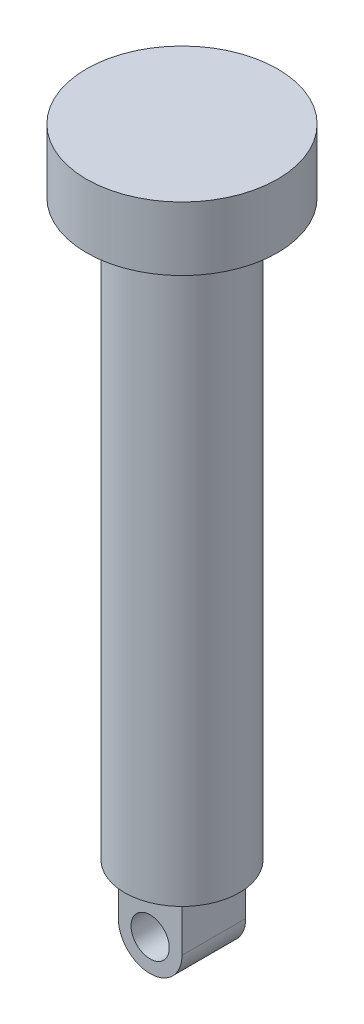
from build123d import *

# Parameters (mm, degrees)
SKETCH1_R           = 15
SKETCH1_R_2         = 9
BOSS_EXTRUDE1_DEPTH = 10
SKETCH1_3_R         = 9
BOSS_EXTRUDE2_DEPTH = 90
SKETCH2_R           = 3
BOSS_EXTRUDE3_DEPTH = 5


with BuildPart() as part:
    # Sketch1 → Boss-Extrude1 (new body)
    # profile 1 of 2: a face of its own
    with BuildSketch(Plane(origin=(0, 0, 0), x_dir=(1, 0, 0), z_dir=(0, 1, 0))):
        with Locations(Location((0, 0, 0), (0, 0, 270))):
            Circle(SKETCH1_R)
        Circle(SKETCH1_R_2, mode=Mode.SUBTRACT)
    # profile 2 of 2: a face of its own
    with BuildSketch(Plane(origin=(0, 0, 0), x_dir=(1, 0, 0), z_dir=(0, 1, 0))):
        Circle(SKETCH1_R_2)
    extrude(amount=BOSS_EXTRUDE1_DEPTH)

    # Sketch1_3 → Boss-Extrude2 (add)
    with BuildSketch(Plane(origin=(0, 0, 0), x_dir=(1, 0, 0), z_dir=(0, 1, 0))):
        with Locations(Location((0, 0, 0), (0, 0, 270))):
            Circle(SKETCH1_3_R)
    extrude(amount=-BOSS_EXTRUDE2_DEPTH)

    # Sketch2 → Boss-Extrude3 (add, symmetric)
    with BuildSketch(Plane.XY):
        with BuildLine():
            Line((-5, -90), (-5, -98))
            ThreePointArc((-5, -98), (0, -103), (5, -98))
            Line((5, -98), (5, -90))
            Line((5, -90), (-5, -90))
        make_face()
        with Locations((0, -98)):
            Circle(SKETCH2_R, mode=Mode.SUBTRACT)
    extrude(amount=BOSS_EXTRUDE3_DEPTH, both=True)


solid = part.part
